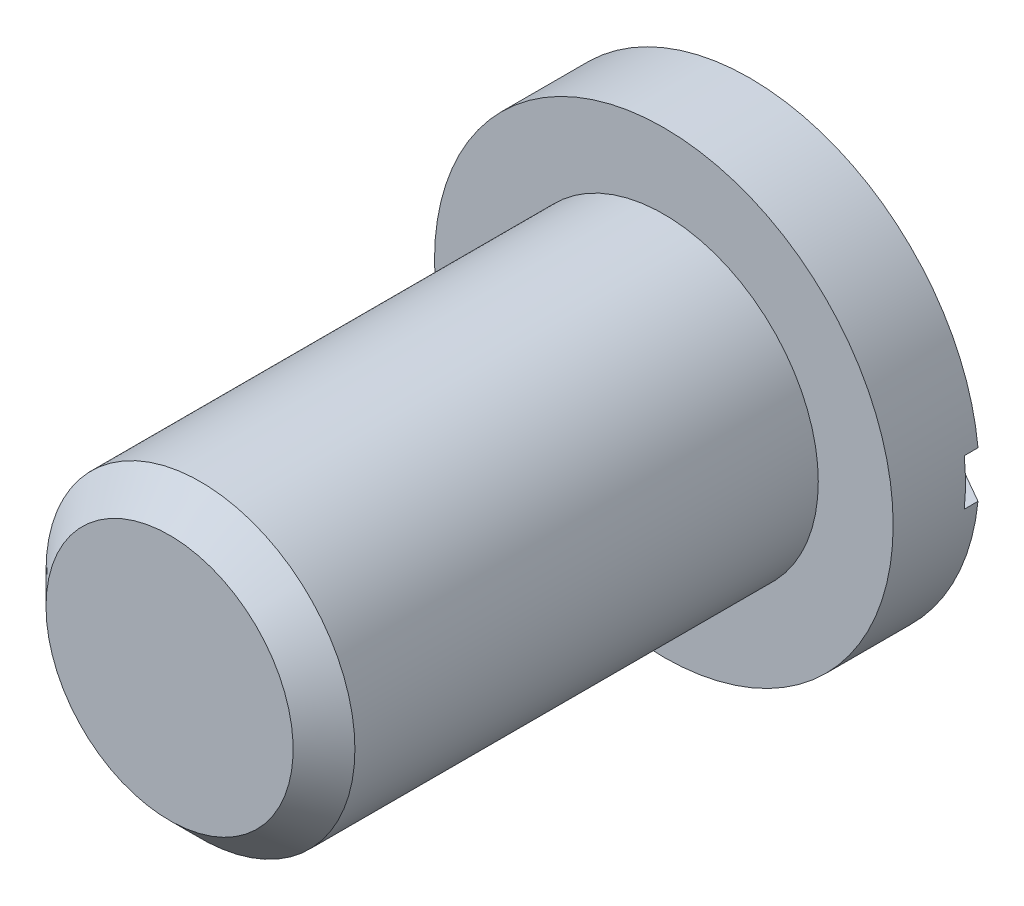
ISO-10303-21;
HEADER;
FILE_DESCRIPTION(('STEP AP214'),'2;1');
FILE_NAME('part.step','',(''),(''),'','','');
FILE_SCHEMA(('AUTOMOTIVE_DESIGN { 1 0 10303 214 1 1 1 1 }'));
ENDSEC;
DATA;
#1=APPLICATION_CONTEXT('core data for automotive mechanical design processes');
#2=APPLICATION_PROTOCOL_DEFINITION('international standard','automotive_design',2000,#1);
#3=PRODUCT_CONTEXT('',#1,'mechanical');
#4=PRODUCT('Part','Part','',(#3));
#5=PRODUCT_RELATED_PRODUCT_CATEGORY('part','',(#4));
#6=PRODUCT_DEFINITION_FORMATION('','',#4);
#7=PRODUCT_DEFINITION_CONTEXT('part definition',#1,'design');
#8=PRODUCT_DEFINITION('design','',#6,#7);
#9=PRODUCT_DEFINITION_SHAPE('','',#8);
#10=(LENGTH_UNIT() NAMED_UNIT(*) SI_UNIT(.MILLI.,.METRE.));
#11=(NAMED_UNIT(*) PLANE_ANGLE_UNIT() SI_UNIT($,.RADIAN.));
#12=(NAMED_UNIT(*) SI_UNIT($,.STERADIAN.) SOLID_ANGLE_UNIT());
#13=UNCERTAINTY_MEASURE_WITH_UNIT(LENGTH_MEASURE(1.E-05),#10,'distance_accuracy_value','');
#14=(GEOMETRIC_REPRESENTATION_CONTEXT(3) GLOBAL_UNCERTAINTY_ASSIGNED_CONTEXT((#13)) GLOBAL_UNIT_ASSIGNED_CONTEXT((#10,
#11,#12)) REPRESENTATION_CONTEXT('',''));
#15=CARTESIAN_POINT('',(0.,0.,0.));
#16=DIRECTION('',(0.,0.,1.));
#17=DIRECTION('',(1.,0.,0.));
#18=AXIS2_PLACEMENT_3D('',#15,#16,#17);
#19=CARTESIAN_POINT('',(0.,4.44099501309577,0.));
#20=DIRECTION('',(0.,0.,-1.));
#21=DIRECTION('',(-1.,0.,0.));
#22=AXIS2_PLACEMENT_3D('',#19,#20,#21);
#23=PLANE('',#22);
#24=DIRECTION('',(1.,0.,0.));
#25=VECTOR('',#24,1.);
#26=CARTESIAN_POINT('',(-6.35,-0.5953125,0.));
#27=LINE('',#26,#25);
#28=CARTESIAN_POINT('',(-4.40091351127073,-0.5953125,0.));
#29=VERTEX_POINT('',#28);
#30=CARTESIAN_POINT('',(4.40091351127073,-0.5953125,0.));
#31=VERTEX_POINT('',#30);
#32=EDGE_CURVE('E196',#29,#31,#27,.T.);
#33=ORIENTED_EDGE('',*,*,#32,.T.);
#34=CARTESIAN_POINT('',(0.,0.,0.));
#35=DIRECTION('',(0.,0.,-1.));
#36=DIRECTION('',(-1.,0.,0.));
#37=AXIS2_PLACEMENT_3D('',#34,#35,#36);
#38=CIRCLE('',#37,4.44099501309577);
#39=EDGE_CURVE('E107',#31,#29,#38,.T.);
#40=ORIENTED_EDGE('',*,*,#39,.T.);
#41=EDGE_LOOP('',(#33,#40));
#42=FACE_BOUND('',#41,.T.);
#43=ADVANCED_FACE('F37',(#42),#23,.T.);
#44=CARTESIAN_POINT('',(0.,0.,0.));
#45=DIRECTION('',(0.,0.,1.));
#46=DIRECTION('',(1.,0.,0.));
#47=AXIS2_PLACEMENT_3D('',#44,#45,#46);
#48=CONICAL_SURFACE('',#47,4.44099501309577,1.0471975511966);
#49=CARTESIAN_POINT('',(12.9822214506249,-0.5953125,4.9391556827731));
#50=CARTESIAN_POINT('',(12.4342294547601,-0.5953125,4.62311047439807));
#51=CARTESIAN_POINT('',(11.8862240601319,-0.5953125,4.30708847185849));
#52=CARTESIAN_POINT('',(10.790156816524,-0.5953125,3.675140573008));
#53=CARTESIAN_POINT('',(10.2420949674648,-0.5953125,3.35921467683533));
#54=CARTESIAN_POINT('',(9.14645986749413,-0.5953125,2.72783987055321));
#55=CARTESIAN_POINT('',(8.59888670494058,-0.5953125,2.41239080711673));
#56=CARTESIAN_POINT('',(7.5035974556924,-0.5953125,1.78174240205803));
#57=CARTESIAN_POINT('',(6.95588136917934,-0.5953125,1.46654306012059));
#58=CARTESIAN_POINT('',(6.13669606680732,-0.5953125,0.995617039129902));
#59=CARTESIAN_POINT('',(5.86533549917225,-0.5953125,0.839701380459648));
#60=CARTESIAN_POINT('',(5.32250596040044,-0.5953125,0.528057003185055));
#61=CARTESIAN_POINT('',(5.05103698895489,-0.5953125,0.372328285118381));
#62=CARTESIAN_POINT('',(4.50774951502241,-0.5953125,0.0610666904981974));
#63=CARTESIAN_POINT('',(4.23593090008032,-0.5953125,-0.0944659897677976));
#64=CARTESIAN_POINT('',(3.69200768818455,-0.5953125,-0.405025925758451));
#65=CARTESIAN_POINT('',(3.41990309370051,-0.5953125,-0.560053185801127));
#66=CARTESIAN_POINT('',(3.01193679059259,-0.5953125,-0.791483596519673));
#67=CARTESIAN_POINT('',(2.87629088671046,-0.5953125,-0.868267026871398));
#68=CARTESIAN_POINT('',(2.60478033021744,-0.5953125,-1.02145390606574));
#69=CARTESIAN_POINT('',(2.4689156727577,-0.5953125,-1.09785734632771));
#70=CARTESIAN_POINT('',(2.1970348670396,-0.5953125,-1.2499532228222));
#71=CARTESIAN_POINT('',(2.06101918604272,-0.5953125,-1.32564649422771));
#72=CARTESIAN_POINT('',(1.78843174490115,-0.5953125,-1.47601227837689));
#73=CARTESIAN_POINT('',(1.65186001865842,-0.5953125,-1.55068485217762));
#74=CARTESIAN_POINT('',(1.44526703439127,-0.5953125,-1.66168550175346));
#75=CARTESIAN_POINT('',(1.37564720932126,-0.5953125,-1.69875941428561));
#76=CARTESIAN_POINT('',(1.23598619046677,-0.5953125,-1.77213219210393));
#77=CARTESIAN_POINT('',(1.16594494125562,-0.5953125,-1.8084309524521));
#78=CARTESIAN_POINT('',(1.02493327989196,-0.5953125,-1.87996629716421));
#79=CARTESIAN_POINT('',(0.953960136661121,-0.5953125,-1.91519751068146));
#80=CARTESIAN_POINT('',(0.81103926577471,-0.5953125,-1.98362007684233));
#81=CARTESIAN_POINT('',(0.739091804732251,-0.5953125,-2.01681197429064));
#82=CARTESIAN_POINT('',(0.627105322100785,-0.5953125,-2.06501444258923));
#83=CARTESIAN_POINT('',(0.587642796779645,-0.5953125,-2.08135409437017));
#84=CARTESIAN_POINT('',(0.508104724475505,-0.5953125,-2.11245424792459));
#85=CARTESIAN_POINT('',(0.468029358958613,-0.5953125,-2.12721520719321));
#86=CARTESIAN_POINT('',(0.387417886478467,-0.5953125,-2.1543649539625));
#87=CARTESIAN_POINT('',(0.34688784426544,-0.5953125,-2.16677141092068));
#88=CARTESIAN_POINT('',(0.264974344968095,-0.5953125,-2.18838242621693));
#89=CARTESIAN_POINT('',(0.2235913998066,-0.5953125,-2.19758884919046));
#90=CARTESIAN_POINT('',(0.14910873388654,-0.5953125,-2.21014869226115));
#91=CARTESIAN_POINT('',(0.116152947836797,-0.5953125,-2.21433728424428));
#92=CARTESIAN_POINT('',(0.0499970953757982,-0.5953125,-2.21961343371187));
#93=CARTESIAN_POINT('',(0.0167971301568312,-0.5953125,-2.22070221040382));
#94=CARTESIAN_POINT('',(-0.0496293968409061,-0.5953125,-2.21964815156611));
#95=CARTESIAN_POINT('',(-0.0828558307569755,-0.5953125,-2.21749754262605));
#96=CARTESIAN_POINT('',(-0.148971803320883,-0.5953125,-2.21020473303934));
#97=CARTESIAN_POINT('',(-0.18186128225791,-0.5953125,-2.2050620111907));
#98=CARTESIAN_POINT('',(-0.260315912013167,-0.5953125,-2.18971049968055));
#99=CARTESIAN_POINT('',(-0.30564023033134,-0.5953125,-2.1782948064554));
#100=CARTESIAN_POINT('',(-0.395303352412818,-0.5953125,-2.152038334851));
#101=CARTESIAN_POINT('',(-0.439640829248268,-0.5953125,-2.13719321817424));
#102=CARTESIAN_POINT('',(-0.527656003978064,-0.5953125,-2.10515291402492));
#103=CARTESIAN_POINT('',(-0.571330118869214,-0.5953125,-2.08794805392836));
#104=CARTESIAN_POINT('',(-0.658006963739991,-0.5953125,-2.05199949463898));
#105=CARTESIAN_POINT('',(-0.701010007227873,-0.5953125,-2.03325654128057));
#106=CARTESIAN_POINT('',(-0.787338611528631,-0.5953125,-1.99434328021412));
#107=CARTESIAN_POINT('',(-0.830654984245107,-0.5953125,-1.97415273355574));
#108=CARTESIAN_POINT('',(-0.916916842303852,-0.5953125,-1.93299325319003));
#109=CARTESIAN_POINT('',(-0.959862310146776,-0.5953125,-1.91202428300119));
#110=CARTESIAN_POINT('',(-1.04535444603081,-0.5953125,-1.86958226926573));
#111=CARTESIAN_POINT('',(-1.08790188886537,-0.5953125,-1.8481107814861));
#112=CARTESIAN_POINT('',(-1.1727809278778,-0.5953125,-1.80475040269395));
#113=CARTESIAN_POINT('',(-1.21511253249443,-0.5953125,-1.7828615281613));
#114=CARTESIAN_POINT('',(-1.35352582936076,-0.5953125,-1.71064100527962));
#115=CARTESIAN_POINT('',(-1.44926655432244,-0.5953125,-1.65965672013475));
#116=CARTESIAN_POINT('',(-1.6402477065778,-0.5953125,-1.55675889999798));
#117=CARTESIAN_POINT('',(-1.73548811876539,-0.5953125,-1.50484533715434));
#118=CARTESIAN_POINT('',(-2.02075516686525,-0.5953125,-1.34823741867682));
#119=CARTESIAN_POINT('',(-2.21031017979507,-0.5953125,-1.242685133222));
#120=CARTESIAN_POINT('',(-2.58906459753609,-0.5953125,-1.03042110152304));
#121=CARTESIAN_POINT('',(-2.77826330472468,-0.5953125,-0.923708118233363));
#122=CARTESIAN_POINT('',(-3.15631998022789,-0.5953125,-0.709702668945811));
#123=CARTESIAN_POINT('',(-3.3451779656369,-0.5953125,-0.602410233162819));
#124=CARTESIAN_POINT('',(-3.71982731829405,-0.5953125,-0.389109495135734));
#125=CARTESIAN_POINT('',(-3.90562168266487,-0.5953125,-0.283106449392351));
#126=CARTESIAN_POINT('',(-4.27708560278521,-0.5953125,-0.0708759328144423));
#127=CARTESIAN_POINT('',(-4.46275515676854,-0.5953125,0.0353515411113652));
#128=CARTESIAN_POINT('',(-5.01948510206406,-0.5953125,0.354173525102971));
#129=CARTESIAN_POINT('',(-5.39041658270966,-0.5953125,0.566993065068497));
#130=CARTESIAN_POINT('',(-6.35723674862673,-0.5953125,1.12223074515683));
#131=CARTESIAN_POINT('',(-6.9529861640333,-0.5953125,1.46489125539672));
#132=CARTESIAN_POINT('',(-8.14437329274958,-0.5953125,2.15061750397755));
#133=CARTESIAN_POINT('',(-8.74001097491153,-0.5953125,2.49368329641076));
#134=CARTESIAN_POINT('',(-9.94349877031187,-0.5953125,3.18710739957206));
#135=CARTESIAN_POINT('',(-10.5513465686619,-0.5953125,3.53746972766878));
#136=CARTESIAN_POINT('',(-11.7668749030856,-0.5953125,4.2382648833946));
#137=CARTESIAN_POINT('',(-12.3745554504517,-0.5953125,4.58869769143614));
#138=CARTESIAN_POINT('',(-12.9822214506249,-0.5953125,4.9391556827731));
#139=B_SPLINE_CURVE_WITH_KNOTS('',3,(#49,#50,#51,#52,#53,#54,#55,#56,#57,#58,#59,#60,#61,#62,
#63,#64,#65,#66,#67,#68,#69,#70,#71,#72,#73,#74,#75,#76,#77,#78,#79,#80,#81,#82,#83,#84,#85,#86,
#87,#88,#89,#90,#91,#92,#93,#94,#95,#96,#97,#98,#99,#100,#101,#102,#103,#104,#105,#106,#107,
#108,#109,#110,#111,#112,#113,#114,#115,#116,#117,#118,#119,#120,#121,#122,#123,#124,#125,#126,
#127,#128,#129,#130,#131,#132,#133,#134,#135,#136,#137,#138),.UNSPECIFIED.,.F.,.F.,(4,2,2,2,2,2,
2,2,2,2,2,2,2,2,2,2,2,2,2,2,2,2,2,2,2,2,2,2,2,2,2,2,2,2,2,2,2,2,2,2,2,2,2,2,4),(0.,
1.8977930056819,3.79558872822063,5.69139996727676,7.58720880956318,8.52609974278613,
9.46499336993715,10.4045047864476,11.3440081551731,11.8116183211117,12.2792389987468,
12.7462148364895,13.2131626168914,13.4497873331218,13.6864438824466,13.9241407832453,
14.1617739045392,14.2898861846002,14.4179612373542,14.5450334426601,14.6720314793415,
14.7715668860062,14.871063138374,14.9707985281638,15.0705512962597,15.2105590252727,
15.3507448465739,15.4915234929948,15.6322342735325,15.7755961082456,15.9189646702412,
16.0619364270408,16.2049025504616,16.5303007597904,16.8557087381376,17.5065839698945,
18.1582385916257,18.8098595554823,19.4515803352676,20.0933100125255,21.376251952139,
23.4380475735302,25.5001594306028,27.6049383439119,29.7093881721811),.UNSPECIFIED.);
#140=CARTESIAN_POINT('',(5.86265254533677,-0.5953125,0.838199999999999));
#141=VERTEX_POINT('',#140);
#142=EDGE_CURVE('E204',#141,#31,#139,.T.);
#143=ORIENTED_EDGE('',*,*,#142,.F.);
#144=CARTESIAN_POINT('',(0.,0.,0.838199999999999));
#145=DIRECTION('',(0.,0.,-1.));
#146=DIRECTION('',(-1.,0.,0.));
#147=AXIS2_PLACEMENT_3D('',#144,#145,#146);
#148=CIRCLE('',#147,5.8928);
#149=CARTESIAN_POINT('',(-5.86265254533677,-0.5953125,0.838199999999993));
#150=VERTEX_POINT('',#149);
#151=EDGE_CURVE('E106',#141,#150,#148,.T.);
#152=ORIENTED_EDGE('',*,*,#151,.T.);
#153=EDGE_CURVE('E97',#29,#150,#139,.T.);
#154=ORIENTED_EDGE('',*,*,#153,.F.);
#155=ORIENTED_EDGE('',*,*,#39,.F.);
#156=EDGE_LOOP('',(#143,#152,#154,#155));
#157=FACE_BOUND('',#156,.T.);
#158=ADVANCED_FACE('F151',(#157),#48,.T.);
#159=DIRECTION('',(1.,0.,0.));
#160=VECTOR('',#159,1.);
#161=CARTESIAN_POINT('',(-6.35,0.5953125,0.));
#162=LINE('',#161,#160);
#163=CARTESIAN_POINT('',(-4.40091351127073,0.5953125,0.));
#164=VERTEX_POINT('',#163);
#165=CARTESIAN_POINT('',(4.40091351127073,0.5953125,0.));
#166=VERTEX_POINT('',#165);
#167=EDGE_CURVE('E52',#164,#166,#162,.T.);
#168=ORIENTED_EDGE('',*,*,#167,.F.);
#169=EDGE_CURVE('E102',#164,#166,#38,.T.);
#170=ORIENTED_EDGE('',*,*,#169,.T.);
#171=EDGE_LOOP('',(#168,#170));
#172=FACE_BOUND('',#171,.T.);
#173=ADVANCED_FACE('F39',(#172),#23,.T.);
#174=CARTESIAN_POINT('',(0.,0.,15.748));
#175=DIRECTION('',(0.,0.,1.));
#176=DIRECTION('',(1.,0.,0.));
#177=AXIS2_PLACEMENT_3D('',#174,#175,#176);
#178=PLANE('',#177);
#179=CARTESIAN_POINT('',(0.,0.,15.748));
#180=DIRECTION('',(0.,0.,-1.));
#181=DIRECTION('',(-1.,0.,0.));
#182=AXIS2_PLACEMENT_3D('',#179,#180,#181);
#183=CIRCLE('',#182,3.175);
#184=CARTESIAN_POINT('',(-3.175,0.,15.748));
#185=VERTEX_POINT('',#184);
#186=EDGE_CURVE('E125',#185,#185,#183,.T.);
#187=ORIENTED_EDGE('',*,*,#186,.F.);
#188=EDGE_LOOP('',(#187));
#189=FACE_BOUND('',#188,.T.);
#190=ADVANCED_FACE('F160',(#189),#178,.T.);
#191=CARTESIAN_POINT('',(0.,0.,14.95425));
#192=DIRECTION('',(0.,0.,-1.));
#193=DIRECTION('',(-1.,0.,0.));
#194=AXIS2_PLACEMENT_3D('',#191,#192,#193);
#195=CONICAL_SURFACE('',#194,3.96875,0.785398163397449);
#196=ORIENTED_EDGE('',*,*,#186,.T.);
#197=EDGE_LOOP('',(#196));
#198=FACE_BOUND('',#197,.T.);
#199=CARTESIAN_POINT('',(0.,0.,14.95425));
#200=DIRECTION('',(0.,0.,-1.));
#201=DIRECTION('',(-1.,0.,0.));
#202=AXIS2_PLACEMENT_3D('',#199,#200,#201);
#203=CIRCLE('',#202,3.96875);
#204=CARTESIAN_POINT('',(-3.96875,0.,14.95425));
#205=VERTEX_POINT('',#204);
#206=EDGE_CURVE('E122',#205,#205,#203,.T.);
#207=ORIENTED_EDGE('',*,*,#206,.F.);
#208=EDGE_LOOP('',(#207));
#209=FACE_BOUND('',#208,.T.);
#210=ADVANCED_FACE('F164',(#198,#209),#195,.T.);
#211=CARTESIAN_POINT('',(0.,0.,0.));
#212=DIRECTION('',(0.,0.,-1.));
#213=DIRECTION('',(-1.,0.,0.));
#214=AXIS2_PLACEMENT_3D('',#211,#212,#213);
#215=CYLINDRICAL_SURFACE('',#214,3.96875);
#216=ORIENTED_EDGE('',*,*,#206,.T.);
#217=EDGE_LOOP('',(#216));
#218=FACE_BOUND('',#217,.T.);
#219=CARTESIAN_POINT('',(0.,0.,3.048));
#220=DIRECTION('',(0.,0.,-1.));
#221=DIRECTION('',(-1.,0.,0.));
#222=AXIS2_PLACEMENT_3D('',#219,#220,#221);
#223=CIRCLE('',#222,3.96875);
#224=CARTESIAN_POINT('',(-3.96875,0.,3.048));
#225=VERTEX_POINT('',#224);
#226=EDGE_CURVE('E119',#225,#225,#223,.T.);
#227=ORIENTED_EDGE('',*,*,#226,.F.);
#228=EDGE_LOOP('',(#227));
#229=FACE_BOUND('',#228,.T.);
#230=ADVANCED_FACE('F169',(#218,#229),#215,.T.);
#231=CARTESIAN_POINT('',(0.,3.96875,3.048));
#232=DIRECTION('',(0.,0.,1.));
#233=DIRECTION('',(1.,0.,0.));
#234=AXIS2_PLACEMENT_3D('',#231,#232,#233);
#235=PLANE('',#234);
#236=ORIENTED_EDGE('',*,*,#226,.T.);
#237=EDGE_LOOP('',(#236));
#238=FACE_BOUND('',#237,.T.);
#239=CARTESIAN_POINT('',(0.,0.,3.048));
#240=DIRECTION('',(0.,0.,-1.));
#241=DIRECTION('',(-1.,0.,0.));
#242=AXIS2_PLACEMENT_3D('',#239,#240,#241);
#243=CIRCLE('',#242,5.8928);
#244=CARTESIAN_POINT('',(-5.8928,0.,3.048));
#245=VERTEX_POINT('',#244);
#246=EDGE_CURVE('E116',#245,#245,#243,.T.);
#247=ORIENTED_EDGE('',*,*,#246,.F.);
#248=EDGE_LOOP('',(#247));
#249=FACE_BOUND('',#248,.T.);
#250=ADVANCED_FACE('F176',(#238,#249),#235,.T.);
#251=CARTESIAN_POINT('',(0.,0.,0.));
#252=DIRECTION('',(0.,0.,-1.));
#253=DIRECTION('',(-1.,0.,0.));
#254=AXIS2_PLACEMENT_3D('',#251,#252,#253);
#255=CYLINDRICAL_SURFACE('',#254,5.8928);
#256=DIRECTION('',(0.,0.,-1.));
#257=VECTOR('',#256,1.);
#258=CARTESIAN_POINT('',(5.86265254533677,-0.5953125,0.));
#259=LINE('',#258,#257);
#260=CARTESIAN_POINT('',(5.86265254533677,-0.5953125,1.190625));
#261=VERTEX_POINT('',#260);
#262=EDGE_CURVE('E60',#261,#141,#259,.T.);
#263=ORIENTED_EDGE('',*,*,#262,.F.);
#264=CARTESIAN_POINT('',(0.,0.,1.190625));
#265=DIRECTION('',(0.,0.,1.));
#266=DIRECTION('',(1.,0.,0.));
#267=AXIS2_PLACEMENT_3D('',#264,#265,#266);
#268=CIRCLE('',#267,5.8928);
#269=CARTESIAN_POINT('',(5.86265254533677,0.5953125,1.190625));
#270=VERTEX_POINT('',#269);
#271=EDGE_CURVE('E11',#270,#261,#268,.F.);
#272=ORIENTED_EDGE('',*,*,#271,.F.);
#273=DIRECTION('',(0.,0.,-1.));
#274=VECTOR('',#273,1.);
#275=CARTESIAN_POINT('',(5.86265254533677,0.5953125,0.));
#276=LINE('',#275,#274);
#277=CARTESIAN_POINT('',(5.86265254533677,0.5953125,0.838199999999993));
#278=VERTEX_POINT('',#277);
#279=EDGE_CURVE('E193',#278,#270,#276,.F.);
#280=ORIENTED_EDGE('',*,*,#279,.F.);
#281=CARTESIAN_POINT('',(-5.86265254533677,0.5953125,0.838199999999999));
#282=VERTEX_POINT('',#281);
#283=EDGE_CURVE('E110',#282,#278,#148,.T.);
#284=ORIENTED_EDGE('',*,*,#283,.F.);
#285=DIRECTION('',(0.,0.,-1.));
#286=VECTOR('',#285,1.);
#287=CARTESIAN_POINT('',(-5.86265254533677,0.5953125,0.));
#288=LINE('',#287,#286);
#289=CARTESIAN_POINT('',(-5.86265254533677,0.5953125,1.190625));
#290=VERTEX_POINT('',#289);
#291=EDGE_CURVE('E92',#290,#282,#288,.T.);
#292=ORIENTED_EDGE('',*,*,#291,.F.);
#293=CARTESIAN_POINT('',(-5.86265254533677,-0.5953125,1.190625));
#294=VERTEX_POINT('',#293);
#295=EDGE_CURVE('E41',#294,#290,#268,.F.);
#296=ORIENTED_EDGE('',*,*,#295,.F.);
#297=DIRECTION('',(0.,0.,-1.));
#298=VECTOR('',#297,1.);
#299=CARTESIAN_POINT('',(-5.86265254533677,-0.5953125,0.));
#300=LINE('',#299,#298);
#301=EDGE_CURVE('E191',#150,#294,#300,.F.);
#302=ORIENTED_EDGE('',*,*,#301,.F.);
#303=ORIENTED_EDGE('',*,*,#151,.F.);
#304=EDGE_LOOP('',(#263,#272,#280,#284,#292,#296,#302,#303));
#305=FACE_BOUND('',#304,.T.);
#306=ORIENTED_EDGE('',*,*,#246,.T.);
#307=EDGE_LOOP('',(#306));
#308=FACE_BOUND('',#307,.T.);
#309=ADVANCED_FACE('F150',(#305,#308),#255,.T.);
#310=CARTESIAN_POINT('',(-12.9822214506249,0.5953125,4.9391556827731));
#311=CARTESIAN_POINT('',(-12.4342294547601,0.5953125,4.62311047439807));
#312=CARTESIAN_POINT('',(-11.8862240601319,0.5953125,4.30708847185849));
#313=CARTESIAN_POINT('',(-10.790156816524,0.5953125,3.675140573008));
#314=CARTESIAN_POINT('',(-10.2420949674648,0.5953125,3.35921467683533));
#315=CARTESIAN_POINT('',(-9.14645986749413,0.5953125,2.72783987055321));
#316=CARTESIAN_POINT('',(-8.59888670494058,0.5953125,2.41239080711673));
#317=CARTESIAN_POINT('',(-7.5035974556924,0.5953125,1.78174240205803));
#318=CARTESIAN_POINT('',(-6.95588136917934,0.5953125,1.46654306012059));
#319=CARTESIAN_POINT('',(-6.13669606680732,0.5953125,0.995617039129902));
#320=CARTESIAN_POINT('',(-5.86533549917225,0.5953125,0.839701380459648));
#321=CARTESIAN_POINT('',(-5.32250596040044,0.5953125,0.528057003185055));
#322=CARTESIAN_POINT('',(-5.05103698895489,0.5953125,0.372328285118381));
#323=CARTESIAN_POINT('',(-4.50774951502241,0.5953125,0.0610666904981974));
#324=CARTESIAN_POINT('',(-4.23593090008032,0.5953125,-0.0944659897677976));
#325=CARTESIAN_POINT('',(-3.69200768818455,0.5953125,-0.405025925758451));
#326=CARTESIAN_POINT('',(-3.41990309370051,0.5953125,-0.560053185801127));
#327=CARTESIAN_POINT('',(-3.01193679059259,0.5953125,-0.791483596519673));
#328=CARTESIAN_POINT('',(-2.87629088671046,0.5953125,-0.868267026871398));
#329=CARTESIAN_POINT('',(-2.60478033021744,0.5953125,-1.02145390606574));
#330=CARTESIAN_POINT('',(-2.4689156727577,0.5953125,-1.09785734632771));
#331=CARTESIAN_POINT('',(-2.1970348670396,0.5953125,-1.2499532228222));
#332=CARTESIAN_POINT('',(-2.06101918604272,0.5953125,-1.32564649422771));
#333=CARTESIAN_POINT('',(-1.78843174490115,0.5953125,-1.47601227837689));
#334=CARTESIAN_POINT('',(-1.65186001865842,0.5953125,-1.55068485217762));
#335=CARTESIAN_POINT('',(-1.44526703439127,0.5953125,-1.66168550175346));
#336=CARTESIAN_POINT('',(-1.37564720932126,0.5953125,-1.69875941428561));
#337=CARTESIAN_POINT('',(-1.23598619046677,0.5953125,-1.77213219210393));
#338=CARTESIAN_POINT('',(-1.16594494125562,0.5953125,-1.8084309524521));
#339=CARTESIAN_POINT('',(-1.02493327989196,0.5953125,-1.87996629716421));
#340=CARTESIAN_POINT('',(-0.953960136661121,0.5953125,-1.91519751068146));
#341=CARTESIAN_POINT('',(-0.81103926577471,0.5953125,-1.98362007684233));
#342=CARTESIAN_POINT('',(-0.739091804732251,0.5953125,-2.01681197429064));
#343=CARTESIAN_POINT('',(-0.627105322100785,0.5953125,-2.06501444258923));
#344=CARTESIAN_POINT('',(-0.587642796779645,0.5953125,-2.08135409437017));
#345=CARTESIAN_POINT('',(-0.508104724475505,0.5953125,-2.11245424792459));
#346=CARTESIAN_POINT('',(-0.468029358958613,0.5953125,-2.12721520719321));
#347=CARTESIAN_POINT('',(-0.387417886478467,0.5953125,-2.1543649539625));
#348=CARTESIAN_POINT('',(-0.34688784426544,0.5953125,-2.16677141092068));
#349=CARTESIAN_POINT('',(-0.264974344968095,0.5953125,-2.18838242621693));
#350=CARTESIAN_POINT('',(-0.2235913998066,0.5953125,-2.19758884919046));
#351=CARTESIAN_POINT('',(-0.14910873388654,0.5953125,-2.21014869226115));
#352=CARTESIAN_POINT('',(-0.116152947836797,0.5953125,-2.21433728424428));
#353=CARTESIAN_POINT('',(-0.0499970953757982,0.5953125,-2.21961343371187));
#354=CARTESIAN_POINT('',(-0.0167971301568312,0.5953125,-2.22070221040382));
#355=CARTESIAN_POINT('',(0.0496293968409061,0.5953125,-2.21964815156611));
#356=CARTESIAN_POINT('',(0.0828558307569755,0.5953125,-2.21749754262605));
#357=CARTESIAN_POINT('',(0.148971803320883,0.5953125,-2.21020473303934));
#358=CARTESIAN_POINT('',(0.18186128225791,0.5953125,-2.2050620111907));
#359=CARTESIAN_POINT('',(0.260315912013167,0.5953125,-2.18971049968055));
#360=CARTESIAN_POINT('',(0.30564023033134,0.5953125,-2.1782948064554));
#361=CARTESIAN_POINT('',(0.395303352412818,0.5953125,-2.152038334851));
#362=CARTESIAN_POINT('',(0.439640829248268,0.5953125,-2.13719321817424));
#363=CARTESIAN_POINT('',(0.527656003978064,0.5953125,-2.10515291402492));
#364=CARTESIAN_POINT('',(0.571330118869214,0.5953125,-2.08794805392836));
#365=CARTESIAN_POINT('',(0.658006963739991,0.5953125,-2.05199949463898));
#366=CARTESIAN_POINT('',(0.701010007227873,0.5953125,-2.03325654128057));
#367=CARTESIAN_POINT('',(0.787338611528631,0.5953125,-1.99434328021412));
#368=CARTESIAN_POINT('',(0.830654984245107,0.5953125,-1.97415273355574));
#369=CARTESIAN_POINT('',(0.916916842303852,0.5953125,-1.93299325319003));
#370=CARTESIAN_POINT('',(0.959862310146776,0.5953125,-1.91202428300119));
#371=CARTESIAN_POINT('',(1.04535444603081,0.5953125,-1.86958226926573));
#372=CARTESIAN_POINT('',(1.08790188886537,0.5953125,-1.8481107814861));
#373=CARTESIAN_POINT('',(1.1727809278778,0.5953125,-1.80475040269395));
#374=CARTESIAN_POINT('',(1.21511253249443,0.5953125,-1.7828615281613));
#375=CARTESIAN_POINT('',(1.35352582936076,0.5953125,-1.71064100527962));
#376=CARTESIAN_POINT('',(1.44926655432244,0.5953125,-1.65965672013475));
#377=CARTESIAN_POINT('',(1.6402477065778,0.5953125,-1.55675889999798));
#378=CARTESIAN_POINT('',(1.73548811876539,0.5953125,-1.50484533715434));
#379=CARTESIAN_POINT('',(2.02075516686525,0.5953125,-1.34823741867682));
#380=CARTESIAN_POINT('',(2.21031017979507,0.5953125,-1.242685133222));
#381=CARTESIAN_POINT('',(2.58906459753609,0.5953125,-1.03042110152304));
#382=CARTESIAN_POINT('',(2.77826330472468,0.5953125,-0.923708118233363));
#383=CARTESIAN_POINT('',(3.15631998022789,0.5953125,-0.709702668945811));
#384=CARTESIAN_POINT('',(3.3451779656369,0.5953125,-0.602410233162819));
#385=CARTESIAN_POINT('',(3.71982731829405,0.5953125,-0.389109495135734));
#386=CARTESIAN_POINT('',(3.90562168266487,0.5953125,-0.283106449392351));
#387=CARTESIAN_POINT('',(4.27708560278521,0.5953125,-0.0708759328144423));
#388=CARTESIAN_POINT('',(4.46275515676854,0.5953125,0.0353515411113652));
#389=CARTESIAN_POINT('',(5.01948510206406,0.5953125,0.354173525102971));
#390=CARTESIAN_POINT('',(5.39041658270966,0.5953125,0.566993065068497));
#391=CARTESIAN_POINT('',(6.35723674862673,0.5953125,1.12223074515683));
#392=CARTESIAN_POINT('',(6.9529861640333,0.5953125,1.46489125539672));
#393=CARTESIAN_POINT('',(8.14437329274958,0.5953125,2.15061750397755));
#394=CARTESIAN_POINT('',(8.74001097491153,0.5953125,2.49368329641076));
#395=CARTESIAN_POINT('',(9.94349877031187,0.5953125,3.18710739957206));
#396=CARTESIAN_POINT('',(10.5513465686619,0.5953125,3.53746972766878));
#397=CARTESIAN_POINT('',(11.7668749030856,0.5953125,4.2382648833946));
#398=CARTESIAN_POINT('',(12.3745554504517,0.5953125,4.58869769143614));
#399=CARTESIAN_POINT('',(12.9822214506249,0.5953125,4.9391556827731));
#400=B_SPLINE_CURVE_WITH_KNOTS('',3,(#310,#311,#312,#313,#314,#315,#316,#317,#318,#319,#320,
#321,#322,#323,#324,#325,#326,#327,#328,#329,#330,#331,#332,#333,#334,#335,#336,#337,#338,#339,
#340,#341,#342,#343,#344,#345,#346,#347,#348,#349,#350,#351,#352,#353,#354,#355,#356,#357,#358,
#359,#360,#361,#362,#363,#364,#365,#366,#367,#368,#369,#370,#371,#372,#373,#374,#375,#376,#377,
#378,#379,#380,#381,#382,#383,#384,#385,#386,#387,#388,#389,#390,#391,#392,#393,#394,#395,#396,
#397,#398,#399),.UNSPECIFIED.,.F.,.F.,(4,2,2,2,2,2,2,2,2,2,2,2,2,2,2,2,2,2,2,2,2,2,2,2,2,2,2,2,
2,2,2,2,2,2,2,2,2,2,2,2,2,2,2,2,4),(0.,1.8977930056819,3.79558872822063,5.69139996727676,
7.58720880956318,8.52609974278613,9.46499336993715,10.4045047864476,11.3440081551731,
11.8116183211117,12.2792389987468,12.7462148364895,13.2131626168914,13.4497873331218,
13.6864438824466,13.9241407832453,14.1617739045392,14.2898861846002,14.4179612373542,
14.5450334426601,14.6720314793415,14.7715668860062,14.871063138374,14.9707985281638,
15.0705512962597,15.2105590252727,15.3507448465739,15.4915234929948,15.6322342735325,
15.7755961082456,15.9189646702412,16.0619364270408,16.2049025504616,16.5303007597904,
16.8557087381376,17.5065839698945,18.1582385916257,18.8098595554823,19.4515803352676,
20.0933100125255,21.376251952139,23.4380475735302,25.5001594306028,27.6049383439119,
29.7093881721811),.UNSPECIFIED.);
#401=EDGE_CURVE('E88',#282,#164,#400,.T.);
#402=ORIENTED_EDGE('',*,*,#401,.F.);
#403=ORIENTED_EDGE('',*,*,#283,.T.);
#404=EDGE_CURVE('E98',#166,#278,#400,.T.);
#405=ORIENTED_EDGE('',*,*,#404,.F.);
#406=ORIENTED_EDGE('',*,*,#169,.F.);
#407=EDGE_LOOP('',(#402,#403,#405,#406));
#408=FACE_BOUND('',#407,.T.);
#409=ADVANCED_FACE('F105',(#408),#48,.T.);
#410=CARTESIAN_POINT('',(-6.35,-0.5953125,0.));
#411=DIRECTION('',(0.,-1.,0.));
#412=DIRECTION('',(0.,0.,-1.));
#413=AXIS2_PLACEMENT_3D('',#410,#411,#412);
#414=PLANE('',#413);
#415=ORIENTED_EDGE('',*,*,#262,.T.);
#416=ORIENTED_EDGE('',*,*,#142,.T.);
#417=ORIENTED_EDGE('',*,*,#32,.F.);
#418=ORIENTED_EDGE('',*,*,#153,.T.);
#419=ORIENTED_EDGE('',*,*,#301,.T.);
#420=DIRECTION('',(1.,0.,0.));
#421=VECTOR('',#420,1.);
#422=CARTESIAN_POINT('',(-6.35,-0.5953125,1.190625));
#423=LINE('',#422,#421);
#424=EDGE_CURVE('E200',#294,#261,#423,.T.);
#425=ORIENTED_EDGE('',*,*,#424,.T.);
#426=EDGE_LOOP('',(#415,#416,#417,#418,#419,#425));
#427=FACE_BOUND('',#426,.T.);
#428=ADVANCED_FACE('F143',(#427),#414,.F.);
#429=CARTESIAN_POINT('',(-6.35,0.5953125,1.190625));
#430=DIRECTION('',(0.,0.,1.));
#431=DIRECTION('',(1.,0.,0.));
#432=AXIS2_PLACEMENT_3D('',#429,#430,#431);
#433=PLANE('',#432);
#434=ORIENTED_EDGE('',*,*,#295,.T.);
#435=DIRECTION('',(1.,0.,0.));
#436=VECTOR('',#435,1.);
#437=CARTESIAN_POINT('',(-6.35,0.5953125,1.190625));
#438=LINE('',#437,#436);
#439=EDGE_CURVE('E103',#290,#270,#438,.T.);
#440=ORIENTED_EDGE('',*,*,#439,.T.);
#441=ORIENTED_EDGE('',*,*,#271,.T.);
#442=ORIENTED_EDGE('',*,*,#424,.F.);
#443=EDGE_LOOP('',(#434,#440,#441,#442));
#444=FACE_BOUND('',#443,.T.);
#445=ADVANCED_FACE('F141',(#444),#433,.F.);
#446=CARTESIAN_POINT('',(-6.35,0.5953125,0.));
#447=DIRECTION('',(0.,1.,0.));
#448=DIRECTION('',(0.,0.,1.));
#449=AXIS2_PLACEMENT_3D('',#446,#447,#448);
#450=PLANE('',#449);
#451=ORIENTED_EDGE('',*,*,#291,.T.);
#452=ORIENTED_EDGE('',*,*,#401,.T.);
#453=ORIENTED_EDGE('',*,*,#167,.T.);
#454=ORIENTED_EDGE('',*,*,#404,.T.);
#455=ORIENTED_EDGE('',*,*,#279,.T.);
#456=ORIENTED_EDGE('',*,*,#439,.F.);
#457=EDGE_LOOP('',(#451,#452,#453,#454,#455,#456));
#458=FACE_BOUND('',#457,.T.);
#459=ADVANCED_FACE('F89',(#458),#450,.F.);
#460=CLOSED_SHELL('',(#43,#158,#173,#190,#210,#230,#250,#309,#409,#428,#445,#459));
#461=MANIFOLD_SOLID_BREP('B2',#460);
#462=ADVANCED_BREP_SHAPE_REPRESENTATION('',(#18,#461),#14);
#463=SHAPE_DEFINITION_REPRESENTATION(#9,#462);
ENDSEC;
END-ISO-10303-21;
